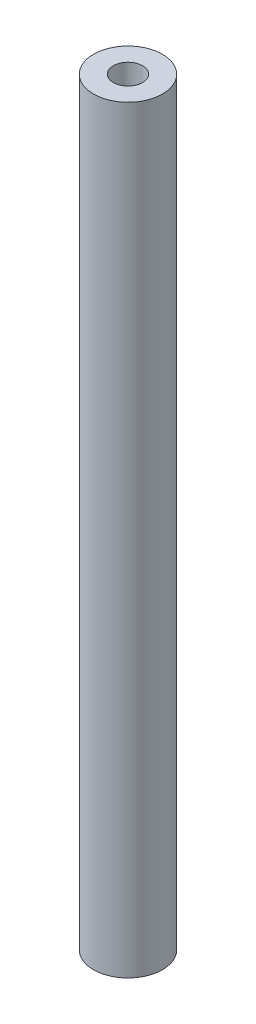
ISO-10303-21;
HEADER;
FILE_DESCRIPTION(('STEP AP214'),'2;1');
FILE_NAME('part.step','',(''),(''),'','','');
FILE_SCHEMA(('AUTOMOTIVE_DESIGN { 1 0 10303 214 1 1 1 1 }'));
ENDSEC;
DATA;
#1=APPLICATION_CONTEXT('core data for automotive mechanical design processes');
#2=APPLICATION_PROTOCOL_DEFINITION('international standard','automotive_design',2000,#1);
#3=PRODUCT_CONTEXT('',#1,'mechanical');
#4=PRODUCT('Part','Part','',(#3));
#5=PRODUCT_RELATED_PRODUCT_CATEGORY('part','',(#4));
#6=PRODUCT_DEFINITION_FORMATION('','',#4);
#7=PRODUCT_DEFINITION_CONTEXT('part definition',#1,'design');
#8=PRODUCT_DEFINITION('design','',#6,#7);
#9=PRODUCT_DEFINITION_SHAPE('','',#8);
#10=(LENGTH_UNIT() NAMED_UNIT(*) SI_UNIT(.MILLI.,.METRE.));
#11=(NAMED_UNIT(*) PLANE_ANGLE_UNIT() SI_UNIT($,.RADIAN.));
#12=(NAMED_UNIT(*) SI_UNIT($,.STERADIAN.) SOLID_ANGLE_UNIT());
#13=UNCERTAINTY_MEASURE_WITH_UNIT(LENGTH_MEASURE(1.E-05),#10,'distance_accuracy_value','');
#14=(GEOMETRIC_REPRESENTATION_CONTEXT(3) GLOBAL_UNCERTAINTY_ASSIGNED_CONTEXT((#13)) GLOBAL_UNIT_ASSIGNED_CONTEXT((#10,
#11,#12)) REPRESENTATION_CONTEXT('',''));
#15=CARTESIAN_POINT('',(0.,0.,0.));
#16=DIRECTION('',(0.,0.,1.));
#17=DIRECTION('',(1.,0.,0.));
#18=AXIS2_PLACEMENT_3D('',#15,#16,#17);
#19=CARTESIAN_POINT('',(0.,104.775,0.));
#20=DIRECTION('',(0.,1.,0.));
#21=DIRECTION('',(0.,0.,1.));
#22=AXIS2_PLACEMENT_3D('',#19,#20,#21);
#23=PLANE('',#22);
#24=CARTESIAN_POINT('',(0.,104.775,0.));
#25=DIRECTION('',(0.,1.,0.));
#26=DIRECTION('',(0.,0.,1.));
#27=AXIS2_PLACEMENT_3D('',#24,#25,#26);
#28=CIRCLE('',#27,4.7625);
#29=CARTESIAN_POINT('',(0.,104.775,4.7625));
#30=VERTEX_POINT('',#29);
#31=EDGE_CURVE('E10',#30,#30,#28,.T.);
#32=ORIENTED_EDGE('',*,*,#31,.T.);
#33=EDGE_LOOP('',(#32));
#34=FACE_BOUND('',#33,.T.);
#35=CARTESIAN_POINT('',(0.,104.775,0.));
#36=DIRECTION('',(0.,1.,0.));
#37=DIRECTION('',(0.,0.,1.));
#38=AXIS2_PLACEMENT_3D('',#35,#36,#37);
#39=CIRCLE('',#38,2.0193);
#40=CARTESIAN_POINT('',(0.,104.775,2.0193));
#41=VERTEX_POINT('',#40);
#42=EDGE_CURVE('E44',#41,#41,#39,.T.);
#43=ORIENTED_EDGE('',*,*,#42,.F.);
#44=EDGE_LOOP('',(#43));
#45=FACE_BOUND('',#44,.T.);
#46=ADVANCED_FACE('F33',(#34,#45),#23,.T.);
#47=CARTESIAN_POINT('',(0.,0.,0.));
#48=DIRECTION('',(0.,1.,0.));
#49=DIRECTION('',(0.,0.,1.));
#50=AXIS2_PLACEMENT_3D('',#47,#48,#49);
#51=PLANE('',#50);
#52=CARTESIAN_POINT('',(0.,0.,0.));
#53=DIRECTION('',(0.,1.,0.));
#54=DIRECTION('',(0.,0.,1.));
#55=AXIS2_PLACEMENT_3D('',#52,#53,#54);
#56=CIRCLE('',#55,4.7625);
#57=CARTESIAN_POINT('',(0.,0.,4.7625));
#58=VERTEX_POINT('',#57);
#59=EDGE_CURVE('E37',#58,#58,#56,.T.);
#60=ORIENTED_EDGE('',*,*,#59,.F.);
#61=EDGE_LOOP('',(#60));
#62=FACE_BOUND('',#61,.T.);
#63=CARTESIAN_POINT('',(0.,0.,0.));
#64=DIRECTION('',(0.,1.,0.));
#65=DIRECTION('',(0.,0.,1.));
#66=AXIS2_PLACEMENT_3D('',#63,#64,#65);
#67=CIRCLE('',#66,2.0193);
#68=CARTESIAN_POINT('',(0.,0.,2.0193));
#69=VERTEX_POINT('',#68);
#70=EDGE_CURVE('E46',#69,#69,#67,.T.);
#71=ORIENTED_EDGE('',*,*,#70,.T.);
#72=EDGE_LOOP('',(#71));
#73=FACE_BOUND('',#72,.T.);
#74=ADVANCED_FACE('F56',(#62,#73),#51,.F.);
#75=CARTESIAN_POINT('',(0.,104.775,0.));
#76=DIRECTION('',(0.,-1.,0.));
#77=DIRECTION('',(0.,0.,-1.));
#78=AXIS2_PLACEMENT_3D('',#75,#76,#77);
#79=CYLINDRICAL_SURFACE('',#78,4.7625);
#80=ORIENTED_EDGE('',*,*,#31,.F.);
#81=EDGE_LOOP('',(#80));
#82=FACE_BOUND('',#81,.T.);
#83=ORIENTED_EDGE('',*,*,#59,.T.);
#84=EDGE_LOOP('',(#83));
#85=FACE_BOUND('',#84,.T.);
#86=ADVANCED_FACE('F35',(#82,#85),#79,.T.);
#87=CARTESIAN_POINT('',(0.,104.775,0.));
#88=DIRECTION('',(0.,-1.,0.));
#89=DIRECTION('',(0.,0.,-1.));
#90=AXIS2_PLACEMENT_3D('',#87,#88,#89);
#91=CYLINDRICAL_SURFACE('',#90,2.0193);
#92=ORIENTED_EDGE('',*,*,#42,.T.);
#93=EDGE_LOOP('',(#92));
#94=FACE_BOUND('',#93,.T.);
#95=ORIENTED_EDGE('',*,*,#70,.F.);
#96=EDGE_LOOP('',(#95));
#97=FACE_BOUND('',#96,.T.);
#98=ADVANCED_FACE('F52',(#94,#97),#91,.F.);
#99=CLOSED_SHELL('',(#46,#74,#86,#98));
#100=MANIFOLD_SOLID_BREP('B2',#99);
#101=ADVANCED_BREP_SHAPE_REPRESENTATION('',(#18,#100),#14);
#102=SHAPE_DEFINITION_REPRESENTATION(#9,#101);
ENDSEC;
END-ISO-10303-21;
